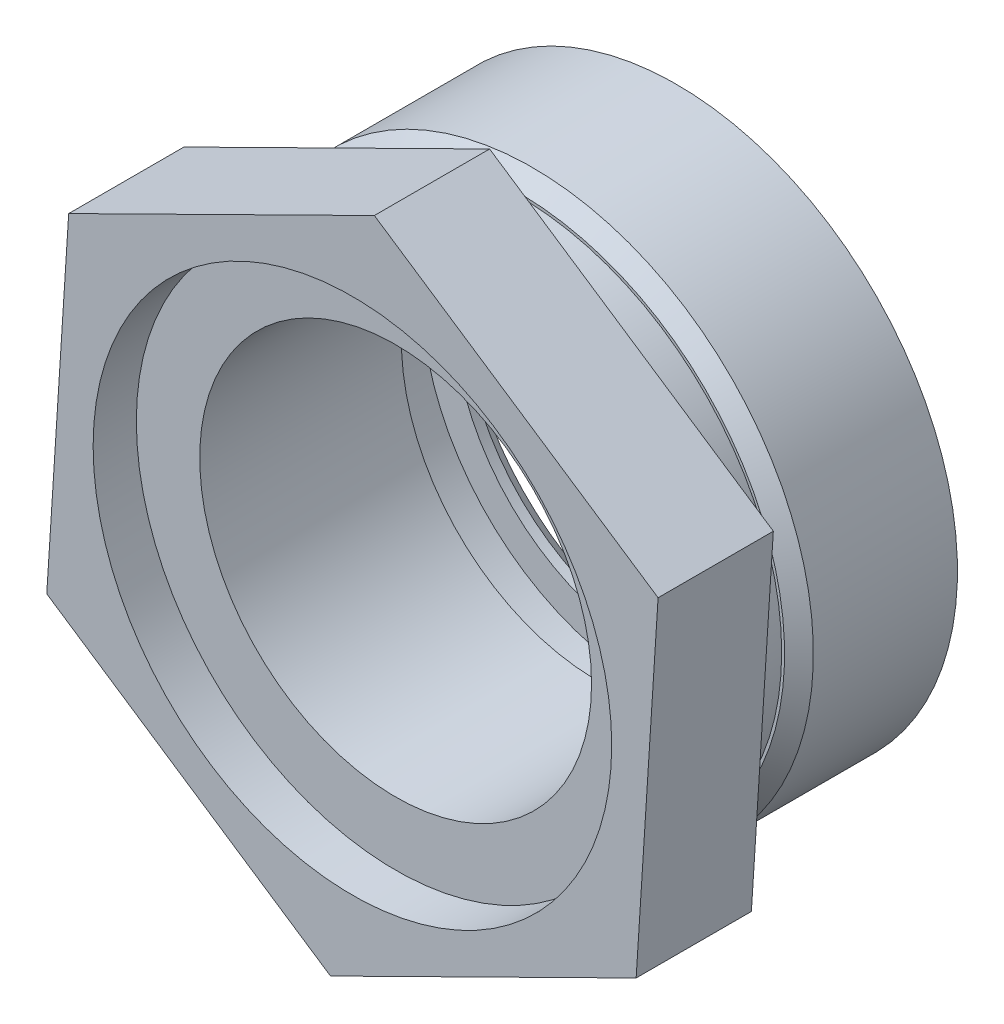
from build123d import *

# Parameters (mm, degrees)
BASE_EXTRUSION_DEPTH    = 8
ESQUISSE6_R             = 19.5
BOSS_EXTRU_2_DEPTH      = 11
CHANFREIN1_SIZE         = 1
ESQUISSE7_R             = 18
ENL_V_MAT_EXTRU_1_DEPTH = 3
ESQUISSE8_R             = 13.6
ENL_V_MAT_EXTRU_2_DEPTH = 38.262827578
CHANFREIN2_SIZE         = 1.2
ESQUISSE9_W             = 15.8
ESQUISSE9_H             = 3.6
CONG_2_R                = 0.2


with BuildPart() as part:
    # Esquisse3 → Base-Extrusion (new body)
    with BuildSketch(Plane.XY):
        Polygon((19.695762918, -13.130508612), (21.219235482, 10.491776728), (1.523472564, 23.62228534), (-19.695762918, 13.130508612), (-21.219235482, -10.491776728), (-1.523472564, -23.62228534), align=None)
    extrude(amount=BASE_EXTRUSION_DEPTH)

    # Esquisse5 → Boss.-R_vol.1 (revolve)
    with BuildSketch(Plane(origin=(0, 0, 0), x_dir=(1, 0, 0), z_dir=(0, 1, 0))):
        Polygon((0, 3.5), (0, 0), (-19.5, 0), (-18.3, 1.2), (-18.3, 3.5), align=None)
    revolve(axis=Axis((0, 0, -10), (0, 0, 1)))

    # Esquisse6 → Boss.-Extru.2 (add)
    with BuildSketch(Plane(origin=(0, 0, -3.5), x_dir=(-1, 0, 0), z_dir=(0, 0, -1))):
        Circle(ESQUISSE6_R)
    extrude(amount=BOSS_EXTRU_2_DEPTH)

    # Chanfrein1
    chanfrein1_edges = [part.edges().sort_by_distance(p)[0] for p in [
        (19.5, 0, -3.5),
    ]]
    chamfer(chanfrein1_edges, length=CHANFREIN1_SIZE)

    # Esquisse7 → Enl_v. mat.-Extru.1 (cut)
    with BuildSketch(Plane.XY.offset(8)):
        Circle(ESQUISSE7_R)
    extrude(amount=-ENL_V_MAT_EXTRU_1_DEPTH, mode=Mode.SUBTRACT)

    # Esquisse8 → Enl_v. mat.-Extru.2 (cut, through all)
    with BuildSketch(Plane.XY.offset(5)):
        with Locations(Location((0, 0, 0), (0, 0, 180))):
            Circle(ESQUISSE8_R)
    extrude(amount=-ENL_V_MAT_EXTRU_2_DEPTH, mode=Mode.SUBTRACT)

    # Chanfrein2
    chanfrein2_edges = [part.edges().sort_by_distance(p)[0] for p in [
        (13.6, 0, -14.5),
    ]]
    chamfer(chanfrein2_edges, length=CHANFREIN2_SIZE)

    # Esquisse9 → Enl_vement de mati_re-R_volution1 (revolve, cut)
    with BuildSketch(Plane(origin=(0, 0, 0), x_dir=(1, 0, 0), z_dir=(0, 1, 0))):
        with Locations((-7.9, 10.8)):
            Rectangle(ESQUISSE9_W, ESQUISSE9_H)
    revolve(axis=Axis((0, 0, -16.546940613), (0, 0, 1)), mode=Mode.SUBTRACT)

    # Cong_2
    cong_2_edges = [part.edges().sort_by_distance(p)[0] for p in [
        (18.3, 0, -1.2),
        (19.5, 0, 0),
    ]]
    fillet(cong_2_edges, radius=CONG_2_R)


solid = part.part
